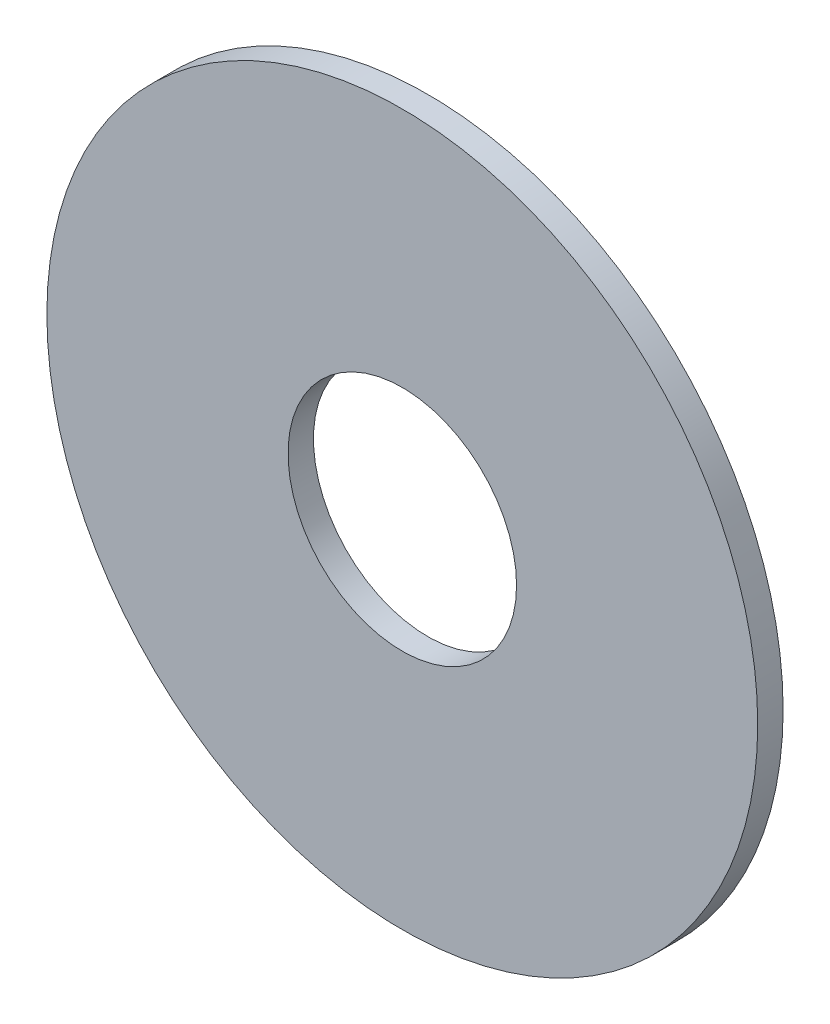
ISO-10303-21;
HEADER;
FILE_DESCRIPTION(('STEP AP214'),'2;1');
FILE_NAME('part.step','',(''),(''),'','','');
FILE_SCHEMA(('AUTOMOTIVE_DESIGN { 1 0 10303 214 1 1 1 1 }'));
ENDSEC;
DATA;
#1=APPLICATION_CONTEXT('core data for automotive mechanical design processes');
#2=APPLICATION_PROTOCOL_DEFINITION('international standard','automotive_design',2000,#1);
#3=PRODUCT_CONTEXT('',#1,'mechanical');
#4=PRODUCT('Part','Part','',(#3));
#5=PRODUCT_RELATED_PRODUCT_CATEGORY('part','',(#4));
#6=PRODUCT_DEFINITION_FORMATION('','',#4);
#7=PRODUCT_DEFINITION_CONTEXT('part definition',#1,'design');
#8=PRODUCT_DEFINITION('design','',#6,#7);
#9=PRODUCT_DEFINITION_SHAPE('','',#8);
#10=(LENGTH_UNIT() NAMED_UNIT(*) SI_UNIT(.MILLI.,.METRE.));
#11=(NAMED_UNIT(*) PLANE_ANGLE_UNIT() SI_UNIT($,.RADIAN.));
#12=(NAMED_UNIT(*) SI_UNIT($,.STERADIAN.) SOLID_ANGLE_UNIT());
#13=UNCERTAINTY_MEASURE_WITH_UNIT(LENGTH_MEASURE(1.E-05),#10,'distance_accuracy_value','');
#14=(GEOMETRIC_REPRESENTATION_CONTEXT(3) GLOBAL_UNCERTAINTY_ASSIGNED_CONTEXT((#13)) GLOBAL_UNIT_ASSIGNED_CONTEXT((#10,
#11,#12)) REPRESENTATION_CONTEXT('',''));
#15=CARTESIAN_POINT('',(0.,0.,0.));
#16=DIRECTION('',(0.,0.,1.));
#17=DIRECTION('',(1.,0.,0.));
#18=AXIS2_PLACEMENT_3D('',#15,#16,#17);
#19=CARTESIAN_POINT('',(0.,0.,6.35));
#20=DIRECTION('',(0.,0.,-1.));
#21=DIRECTION('',(-1.,0.,0.));
#22=AXIS2_PLACEMENT_3D('',#19,#20,#21);
#23=CYLINDRICAL_SURFACE('',#22,88.9);
#24=CARTESIAN_POINT('',(0.,0.,6.35));
#25=DIRECTION('',(0.,0.,1.));
#26=DIRECTION('',(1.,0.,0.));
#27=AXIS2_PLACEMENT_3D('',#24,#25,#26);
#28=CIRCLE('',#27,88.9);
#29=CARTESIAN_POINT('',(88.9,0.,6.35));
#30=VERTEX_POINT('',#29);
#31=EDGE_CURVE('E10',#30,#30,#28,.T.);
#32=ORIENTED_EDGE('',*,*,#31,.F.);
#33=EDGE_LOOP('',(#32));
#34=FACE_BOUND('',#33,.T.);
#35=CARTESIAN_POINT('',(0.,0.,0.));
#36=DIRECTION('',(0.,0.,1.));
#37=DIRECTION('',(1.,0.,0.));
#38=AXIS2_PLACEMENT_3D('',#35,#36,#37);
#39=CIRCLE('',#38,88.9);
#40=CARTESIAN_POINT('',(88.9,0.,0.));
#41=VERTEX_POINT('',#40);
#42=EDGE_CURVE('E33',#41,#41,#39,.T.);
#43=ORIENTED_EDGE('',*,*,#42,.T.);
#44=EDGE_LOOP('',(#43));
#45=FACE_BOUND('',#44,.T.);
#46=ADVANCED_FACE('F30',(#34,#45),#23,.T.);
#47=CARTESIAN_POINT('',(0.,0.,6.35));
#48=DIRECTION('',(0.,0.,1.));
#49=DIRECTION('',(1.,0.,0.));
#50=AXIS2_PLACEMENT_3D('',#47,#48,#49);
#51=PLANE('',#50);
#52=CARTESIAN_POINT('',(0.,0.,6.35));
#53=DIRECTION('',(0.,0.,1.));
#54=DIRECTION('',(1.,0.,0.));
#55=AXIS2_PLACEMENT_3D('',#52,#53,#54);
#56=CIRCLE('',#55,28.575);
#57=CARTESIAN_POINT('',(28.575,0.,6.35));
#58=VERTEX_POINT('',#57);
#59=EDGE_CURVE('E42',#58,#58,#56,.T.);
#60=ORIENTED_EDGE('',*,*,#59,.F.);
#61=EDGE_LOOP('',(#60));
#62=FACE_BOUND('',#61,.T.);
#63=ORIENTED_EDGE('',*,*,#31,.T.);
#64=EDGE_LOOP('',(#63));
#65=FACE_BOUND('',#64,.T.);
#66=ADVANCED_FACE('F57',(#62,#65),#51,.T.);
#67=CARTESIAN_POINT('',(0.,0.,0.));
#68=DIRECTION('',(0.,0.,1.));
#69=DIRECTION('',(1.,0.,0.));
#70=AXIS2_PLACEMENT_3D('',#67,#68,#69);
#71=PLANE('',#70);
#72=CARTESIAN_POINT('',(0.,0.,0.));
#73=DIRECTION('',(0.,0.,1.));
#74=DIRECTION('',(1.,0.,0.));
#75=AXIS2_PLACEMENT_3D('',#72,#73,#74);
#76=CIRCLE('',#75,28.575);
#77=CARTESIAN_POINT('',(28.575,0.,0.));
#78=VERTEX_POINT('',#77);
#79=EDGE_CURVE('E40',#78,#78,#76,.T.);
#80=ORIENTED_EDGE('',*,*,#79,.T.);
#81=EDGE_LOOP('',(#80));
#82=FACE_BOUND('',#81,.T.);
#83=ORIENTED_EDGE('',*,*,#42,.F.);
#84=EDGE_LOOP('',(#83));
#85=FACE_BOUND('',#84,.T.);
#86=ADVANCED_FACE('F48',(#82,#85),#71,.F.);
#87=CARTESIAN_POINT('',(0.,0.,0.));
#88=DIRECTION('',(0.,0.,1.));
#89=DIRECTION('',(1.,0.,0.));
#90=AXIS2_PLACEMENT_3D('',#87,#88,#89);
#91=CYLINDRICAL_SURFACE('',#90,28.575);
#92=ORIENTED_EDGE('',*,*,#79,.F.);
#93=EDGE_LOOP('',(#92));
#94=FACE_BOUND('',#93,.T.);
#95=ORIENTED_EDGE('',*,*,#59,.T.);
#96=EDGE_LOOP('',(#95));
#97=FACE_BOUND('',#96,.T.);
#98=ADVANCED_FACE('F51',(#94,#97),#91,.F.);
#99=CLOSED_SHELL('',(#46,#66,#86,#98));
#100=MANIFOLD_SOLID_BREP('B2',#99);
#101=ADVANCED_BREP_SHAPE_REPRESENTATION('',(#18,#100),#14);
#102=SHAPE_DEFINITION_REPRESENTATION(#9,#101);
ENDSEC;
END-ISO-10303-21;
